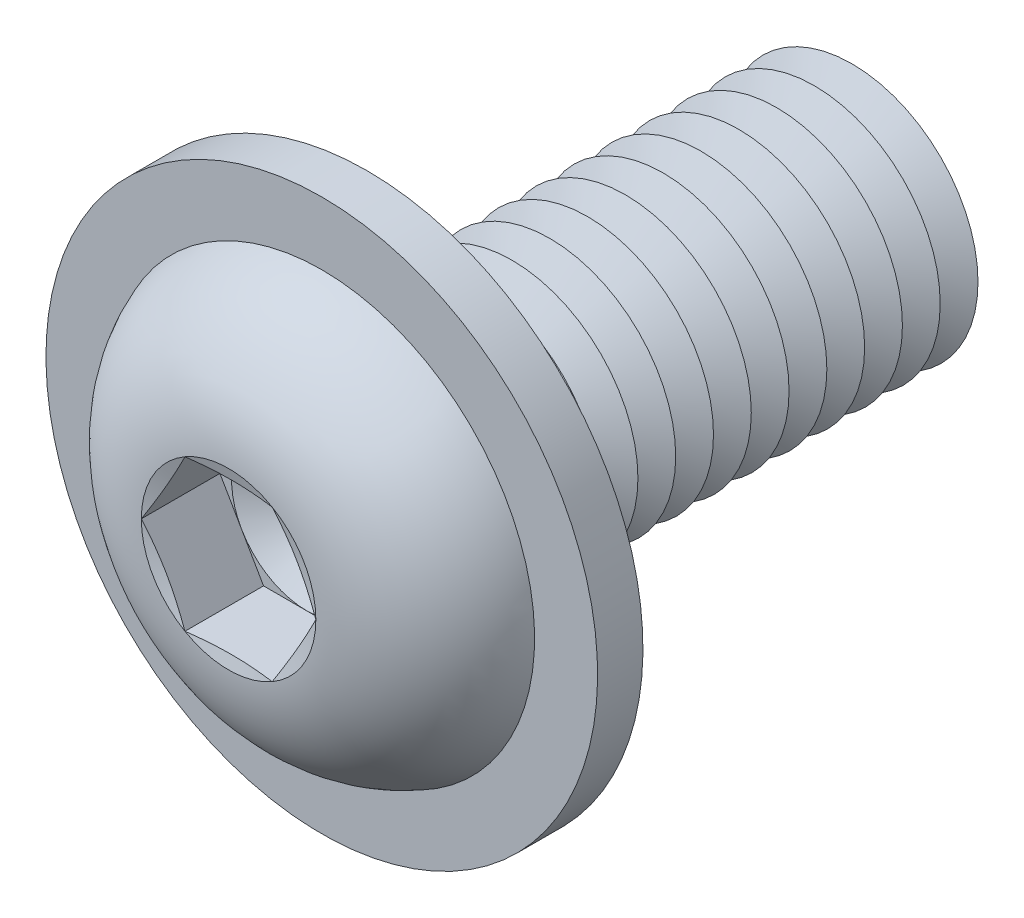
ISO-10303-21;
HEADER;
FILE_DESCRIPTION(('STEP AP214'),'2;1');
FILE_NAME('part.step','',(''),(''),'','','');
FILE_SCHEMA(('AUTOMOTIVE_DESIGN { 1 0 10303 214 1 1 1 1 }'));
ENDSEC;
DATA;
#1=APPLICATION_CONTEXT('core data for automotive mechanical design processes');
#2=APPLICATION_PROTOCOL_DEFINITION('international standard','automotive_design',2000,#1);
#3=PRODUCT_CONTEXT('',#1,'mechanical');
#4=PRODUCT('Part','Part','',(#3));
#5=PRODUCT_RELATED_PRODUCT_CATEGORY('part','',(#4));
#6=PRODUCT_DEFINITION_FORMATION('','',#4);
#7=PRODUCT_DEFINITION_CONTEXT('part definition',#1,'design');
#8=PRODUCT_DEFINITION('design','',#6,#7);
#9=PRODUCT_DEFINITION_SHAPE('','',#8);
#10=(LENGTH_UNIT() NAMED_UNIT(*) SI_UNIT(.MILLI.,.METRE.));
#11=(NAMED_UNIT(*) PLANE_ANGLE_UNIT() SI_UNIT($,.RADIAN.));
#12=(NAMED_UNIT(*) SI_UNIT($,.STERADIAN.) SOLID_ANGLE_UNIT());
#13=UNCERTAINTY_MEASURE_WITH_UNIT(LENGTH_MEASURE(1.E-05),#10,'distance_accuracy_value','');
#14=(GEOMETRIC_REPRESENTATION_CONTEXT(3) GLOBAL_UNCERTAINTY_ASSIGNED_CONTEXT((#13)) GLOBAL_UNIT_ASSIGNED_CONTEXT((#10,
#11,#12)) REPRESENTATION_CONTEXT('',''));
#15=CARTESIAN_POINT('',(0.,0.,0.));
#16=DIRECTION('',(0.,0.,1.));
#17=DIRECTION('',(1.,0.,0.));
#18=AXIS2_PLACEMENT_3D('',#15,#16,#17);
#19=CARTESIAN_POINT('',(0.,0.,-14.75));
#20=DIRECTION('',(0.,0.,1.));
#21=DIRECTION('',(1.,0.,0.));
#22=AXIS2_PLACEMENT_3D('',#19,#20,#21);
#23=CONICAL_SURFACE('',#22,5.,1.0471975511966);
#24=CARTESIAN_POINT('',(0.,0.,-15.5));
#25=DIRECTION('',(0.,0.,1.));
#26=DIRECTION('',(1.,0.,0.));
#27=AXIS2_PLACEMENT_3D('',#24,#25,#26);
#28=CIRCLE('',#27,3.70096189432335);
#29=CARTESIAN_POINT('',(3.70096189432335,0.,-15.5));
#30=VERTEX_POINT('',#29);
#31=EDGE_CURVE('E383',#30,#30,#28,.T.);
#32=ORIENTED_EDGE('',*,*,#31,.T.);
#33=EDGE_LOOP('',(#32));
#34=FACE_BOUND('',#33,.T.);
#35=CARTESIAN_POINT('',(0.,0.,-14.75));
#36=DIRECTION('',(0.,0.,1.));
#37=DIRECTION('',(1.,0.,0.));
#38=AXIS2_PLACEMENT_3D('',#35,#36,#37);
#39=CIRCLE('',#38,5.);
#40=CARTESIAN_POINT('',(5.,0.,-14.75));
#41=VERTEX_POINT('',#40);
#42=EDGE_CURVE('E398',#41,#41,#39,.T.);
#43=ORIENTED_EDGE('',*,*,#42,.F.);
#44=EDGE_LOOP('',(#43));
#45=FACE_BOUND('',#44,.T.);
#46=ADVANCED_FACE('F39',(#34,#45),#23,.T.);
#47=CARTESIAN_POINT('',(0.,0.,-15.5));
#48=DIRECTION('',(0.,0.,-1.));
#49=DIRECTION('',(-1.,0.,0.));
#50=AXIS2_PLACEMENT_3D('',#47,#48,#49);
#51=CONICAL_SURFACE('',#50,3.70096189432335,1.0471975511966);
#52=CARTESIAN_POINT('',(0.,0.,-16.25));
#53=DIRECTION('',(0.,0.,1.));
#54=DIRECTION('',(1.,0.,0.));
#55=AXIS2_PLACEMENT_3D('',#52,#53,#54);
#56=CIRCLE('',#55,5.);
#57=CARTESIAN_POINT('',(5.,0.,-16.25));
#58=VERTEX_POINT('',#57);
#59=EDGE_CURVE('E334',#58,#58,#56,.T.);
#60=ORIENTED_EDGE('',*,*,#59,.T.);
#61=EDGE_LOOP('',(#60));
#62=FACE_BOUND('',#61,.T.);
#63=ORIENTED_EDGE('',*,*,#31,.F.);
#64=EDGE_LOOP('',(#63));
#65=FACE_BOUND('',#64,.T.);
#66=ADVANCED_FACE('F467',(#62,#65),#51,.T.);
#67=CARTESIAN_POINT('',(0.,5.00000000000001,-20.));
#68=DIRECTION('',(0.,0.,-1.));
#69=DIRECTION('',(-1.,0.,0.));
#70=AXIS2_PLACEMENT_3D('',#67,#68,#69);
#71=PLANE('',#70);
#72=CARTESIAN_POINT('',(0.,0.,-20.));
#73=DIRECTION('',(0.,0.,1.));
#74=DIRECTION('',(1.,0.,0.));
#75=AXIS2_PLACEMENT_3D('',#72,#73,#74);
#76=CIRCLE('',#75,3.70096189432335);
#77=CARTESIAN_POINT('',(3.70096189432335,0.,-20.));
#78=VERTEX_POINT('',#77);
#79=EDGE_CURVE('E307',#78,#78,#76,.T.);
#80=ORIENTED_EDGE('',*,*,#79,.F.);
#81=EDGE_LOOP('',(#80));
#82=FACE_BOUND('',#81,.T.);
#83=ADVANCED_FACE('F473',(#82),#71,.T.);
#84=CARTESIAN_POINT('',(0.,0.,-19.25));
#85=DIRECTION('',(0.,0.,1.));
#86=DIRECTION('',(1.,0.,0.));
#87=AXIS2_PLACEMENT_3D('',#84,#85,#86);
#88=CONICAL_SURFACE('',#87,5.,1.0471975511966);
#89=ORIENTED_EDGE('',*,*,#79,.T.);
#90=EDGE_LOOP('',(#89));
#91=FACE_BOUND('',#90,.T.);
#92=CARTESIAN_POINT('',(0.,0.,-19.25));
#93=DIRECTION('',(0.,0.,1.));
#94=DIRECTION('',(1.,0.,0.));
#95=AXIS2_PLACEMENT_3D('',#92,#93,#94);
#96=CIRCLE('',#95,5.);
#97=CARTESIAN_POINT('',(5.,0.,-19.25));
#98=VERTEX_POINT('',#97);
#99=EDGE_CURVE('E388',#98,#98,#96,.T.);
#100=ORIENTED_EDGE('',*,*,#99,.F.);
#101=EDGE_LOOP('',(#100));
#102=FACE_BOUND('',#101,.T.);
#103=ADVANCED_FACE('F492',(#91,#102),#88,.T.);
#104=CARTESIAN_POINT('',(0.,0.,-18.5));
#105=DIRECTION('',(0.,0.,-1.));
#106=DIRECTION('',(-1.,0.,0.));
#107=AXIS2_PLACEMENT_3D('',#104,#105,#106);
#108=CONICAL_SURFACE('',#107,3.70096189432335,1.0471975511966);
#109=ORIENTED_EDGE('',*,*,#99,.T.);
#110=EDGE_LOOP('',(#109));
#111=FACE_BOUND('',#110,.T.);
#112=CARTESIAN_POINT('',(0.,0.,-18.5));
#113=DIRECTION('',(0.,0.,1.));
#114=DIRECTION('',(1.,0.,0.));
#115=AXIS2_PLACEMENT_3D('',#112,#113,#114);
#116=CIRCLE('',#115,3.70096189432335);
#117=CARTESIAN_POINT('',(3.70096189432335,0.,-18.5));
#118=VERTEX_POINT('',#117);
#119=EDGE_CURVE('E360',#118,#118,#116,.T.);
#120=ORIENTED_EDGE('',*,*,#119,.F.);
#121=EDGE_LOOP('',(#120));
#122=FACE_BOUND('',#121,.T.);
#123=ADVANCED_FACE('F489',(#111,#122),#108,.T.);
#124=CARTESIAN_POINT('',(0.,0.,-17.75));
#125=DIRECTION('',(0.,0.,1.));
#126=DIRECTION('',(1.,0.,0.));
#127=AXIS2_PLACEMENT_3D('',#124,#125,#126);
#128=CONICAL_SURFACE('',#127,5.,1.0471975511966);
#129=ORIENTED_EDGE('',*,*,#119,.T.);
#130=EDGE_LOOP('',(#129));
#131=FACE_BOUND('',#130,.T.);
#132=CARTESIAN_POINT('',(0.,0.,-17.75));
#133=DIRECTION('',(0.,0.,1.));
#134=DIRECTION('',(1.,0.,0.));
#135=AXIS2_PLACEMENT_3D('',#132,#133,#134);
#136=CIRCLE('',#135,5.);
#137=CARTESIAN_POINT('',(5.,0.,-17.75));
#138=VERTEX_POINT('',#137);
#139=EDGE_CURVE('E333',#138,#138,#136,.T.);
#140=ORIENTED_EDGE('',*,*,#139,.F.);
#141=EDGE_LOOP('',(#140));
#142=FACE_BOUND('',#141,.T.);
#143=ADVANCED_FACE('F483',(#131,#142),#128,.T.);
#144=CARTESIAN_POINT('',(0.,0.,-17.));
#145=DIRECTION('',(0.,0.,-1.));
#146=DIRECTION('',(-1.,0.,0.));
#147=AXIS2_PLACEMENT_3D('',#144,#145,#146);
#148=CONICAL_SURFACE('',#147,3.70096189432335,1.0471975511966);
#149=ORIENTED_EDGE('',*,*,#139,.T.);
#150=EDGE_LOOP('',(#149));
#151=FACE_BOUND('',#150,.T.);
#152=CARTESIAN_POINT('',(0.,0.,-17.));
#153=DIRECTION('',(0.,0.,1.));
#154=DIRECTION('',(1.,0.,0.));
#155=AXIS2_PLACEMENT_3D('',#152,#153,#154);
#156=CIRCLE('',#155,3.70096189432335);
#157=CARTESIAN_POINT('',(3.70096189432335,0.,-17.));
#158=VERTEX_POINT('',#157);
#159=EDGE_CURVE('E331',#158,#158,#156,.T.);
#160=ORIENTED_EDGE('',*,*,#159,.F.);
#161=EDGE_LOOP('',(#160));
#162=FACE_BOUND('',#161,.T.);
#163=ADVANCED_FACE('F479',(#151,#162),#148,.T.);
#164=CARTESIAN_POINT('',(0.,0.,-16.25));
#165=DIRECTION('',(0.,0.,1.));
#166=DIRECTION('',(1.,0.,0.));
#167=AXIS2_PLACEMENT_3D('',#164,#165,#166);
#168=CONICAL_SURFACE('',#167,5.,1.0471975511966);
#169=ORIENTED_EDGE('',*,*,#159,.T.);
#170=EDGE_LOOP('',(#169));
#171=FACE_BOUND('',#170,.T.);
#172=ORIENTED_EDGE('',*,*,#59,.F.);
#173=EDGE_LOOP('',(#172));
#174=FACE_BOUND('',#173,.T.);
#175=ADVANCED_FACE('F482',(#171,#174),#168,.T.);
#176=CARTESIAN_POINT('',(0.,0.,-13.25));
#177=DIRECTION('',(0.,0.,1.));
#178=DIRECTION('',(1.,0.,0.));
#179=AXIS2_PLACEMENT_3D('',#176,#177,#178);
#180=CONICAL_SURFACE('',#179,5.,1.0471975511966);
#181=CARTESIAN_POINT('',(0.,0.,-14.));
#182=DIRECTION('',(0.,0.,1.));
#183=DIRECTION('',(1.,0.,0.));
#184=AXIS2_PLACEMENT_3D('',#181,#182,#183);
#185=CIRCLE('',#184,3.70096189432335);
#186=CARTESIAN_POINT('',(3.70096189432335,0.,-14.));
#187=VERTEX_POINT('',#186);
#188=EDGE_CURVE('E419',#187,#187,#185,.T.);
#189=ORIENTED_EDGE('',*,*,#188,.T.);
#190=EDGE_LOOP('',(#189));
#191=FACE_BOUND('',#190,.T.);
#192=CARTESIAN_POINT('',(0.,0.,-13.25));
#193=DIRECTION('',(0.,0.,1.));
#194=DIRECTION('',(1.,0.,0.));
#195=AXIS2_PLACEMENT_3D('',#192,#193,#194);
#196=CIRCLE('',#195,5.);
#197=CARTESIAN_POINT('',(5.,0.,-13.25));
#198=VERTEX_POINT('',#197);
#199=EDGE_CURVE('E373',#198,#198,#196,.T.);
#200=ORIENTED_EDGE('',*,*,#199,.F.);
#201=EDGE_LOOP('',(#200));
#202=FACE_BOUND('',#201,.T.);
#203=ADVANCED_FACE('F487',(#191,#202),#180,.T.);
#204=CARTESIAN_POINT('',(0.,0.,-14.));
#205=DIRECTION('',(0.,0.,-1.));
#206=DIRECTION('',(-1.,0.,0.));
#207=AXIS2_PLACEMENT_3D('',#204,#205,#206);
#208=CONICAL_SURFACE('',#207,3.70096189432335,1.0471975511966);
#209=ORIENTED_EDGE('',*,*,#42,.T.);
#210=EDGE_LOOP('',(#209));
#211=FACE_BOUND('',#210,.T.);
#212=ORIENTED_EDGE('',*,*,#188,.F.);
#213=EDGE_LOOP('',(#212));
#214=FACE_BOUND('',#213,.T.);
#215=ADVANCED_FACE('F539',(#211,#214),#208,.T.);
#216=CARTESIAN_POINT('',(0.,0.,-11.75));
#217=DIRECTION('',(0.,0.,1.));
#218=DIRECTION('',(1.,0.,0.));
#219=AXIS2_PLACEMENT_3D('',#216,#217,#218);
#220=CONICAL_SURFACE('',#219,5.,1.0471975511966);
#221=CARTESIAN_POINT('',(0.,0.,-12.5));
#222=DIRECTION('',(0.,0.,1.));
#223=DIRECTION('',(1.,0.,0.));
#224=AXIS2_PLACEMENT_3D('',#221,#222,#223);
#225=CIRCLE('',#224,3.70096189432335);
#226=CARTESIAN_POINT('',(3.70096189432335,0.,-12.5));
#227=VERTEX_POINT('',#226);
#228=EDGE_CURVE('E370',#227,#227,#225,.T.);
#229=ORIENTED_EDGE('',*,*,#228,.T.);
#230=EDGE_LOOP('',(#229));
#231=FACE_BOUND('',#230,.T.);
#232=CARTESIAN_POINT('',(0.,0.,-11.75));
#233=DIRECTION('',(0.,0.,1.));
#234=DIRECTION('',(1.,0.,0.));
#235=AXIS2_PLACEMENT_3D('',#232,#233,#234);
#236=CIRCLE('',#235,5.);
#237=CARTESIAN_POINT('',(5.,0.,-11.75));
#238=VERTEX_POINT('',#237);
#239=EDGE_CURVE('E339',#238,#238,#236,.T.);
#240=ORIENTED_EDGE('',*,*,#239,.F.);
#241=EDGE_LOOP('',(#240));
#242=FACE_BOUND('',#241,.T.);
#243=ADVANCED_FACE('F545',(#231,#242),#220,.T.);
#244=CARTESIAN_POINT('',(0.,0.,-12.5));
#245=DIRECTION('',(0.,0.,-1.));
#246=DIRECTION('',(-1.,0.,0.));
#247=AXIS2_PLACEMENT_3D('',#244,#245,#246);
#248=CONICAL_SURFACE('',#247,3.70096189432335,1.0471975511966);
#249=ORIENTED_EDGE('',*,*,#199,.T.);
#250=EDGE_LOOP('',(#249));
#251=FACE_BOUND('',#250,.T.);
#252=ORIENTED_EDGE('',*,*,#228,.F.);
#253=EDGE_LOOP('',(#252));
#254=FACE_BOUND('',#253,.T.);
#255=ADVANCED_FACE('F552',(#251,#254),#248,.T.);
#256=CARTESIAN_POINT('',(0.,0.,-10.25));
#257=DIRECTION('',(0.,0.,1.));
#258=DIRECTION('',(1.,0.,0.));
#259=AXIS2_PLACEMENT_3D('',#256,#257,#258);
#260=CONICAL_SURFACE('',#259,5.,1.0471975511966);
#261=CARTESIAN_POINT('',(0.,0.,-11.));
#262=DIRECTION('',(0.,0.,1.));
#263=DIRECTION('',(1.,0.,0.));
#264=AXIS2_PLACEMENT_3D('',#261,#262,#263);
#265=CIRCLE('',#264,3.70096189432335);
#266=CARTESIAN_POINT('',(3.70096189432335,0.,-11.));
#267=VERTEX_POINT('',#266);
#268=EDGE_CURVE('E337',#267,#267,#265,.T.);
#269=ORIENTED_EDGE('',*,*,#268,.T.);
#270=EDGE_LOOP('',(#269));
#271=FACE_BOUND('',#270,.T.);
#272=CARTESIAN_POINT('',(0.,0.,-10.25));
#273=DIRECTION('',(0.,0.,1.));
#274=DIRECTION('',(1.,0.,0.));
#275=AXIS2_PLACEMENT_3D('',#272,#273,#274);
#276=CIRCLE('',#275,5.);
#277=CARTESIAN_POINT('',(5.,0.,-10.25));
#278=VERTEX_POINT('',#277);
#279=EDGE_CURVE('E340',#278,#278,#276,.T.);
#280=ORIENTED_EDGE('',*,*,#279,.F.);
#281=EDGE_LOOP('',(#280));
#282=FACE_BOUND('',#281,.T.);
#283=ADVANCED_FACE('F559',(#271,#282),#260,.T.);
#284=CARTESIAN_POINT('',(0.,0.,-11.));
#285=DIRECTION('',(0.,0.,-1.));
#286=DIRECTION('',(-1.,0.,0.));
#287=AXIS2_PLACEMENT_3D('',#284,#285,#286);
#288=CONICAL_SURFACE('',#287,3.70096189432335,1.0471975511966);
#289=ORIENTED_EDGE('',*,*,#239,.T.);
#290=EDGE_LOOP('',(#289));
#291=FACE_BOUND('',#290,.T.);
#292=ORIENTED_EDGE('',*,*,#268,.F.);
#293=EDGE_LOOP('',(#292));
#294=FACE_BOUND('',#293,.T.);
#295=ADVANCED_FACE('F565',(#291,#294),#288,.T.);
#296=CARTESIAN_POINT('',(0.,0.,-8.75));
#297=DIRECTION('',(0.,0.,1.));
#298=DIRECTION('',(1.,0.,0.));
#299=AXIS2_PLACEMENT_3D('',#296,#297,#298);
#300=CONICAL_SURFACE('',#299,5.,1.0471975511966);
#301=CARTESIAN_POINT('',(0.,0.,-9.5));
#302=DIRECTION('',(0.,0.,1.));
#303=DIRECTION('',(1.,0.,0.));
#304=AXIS2_PLACEMENT_3D('',#301,#302,#303);
#305=CIRCLE('',#304,3.70096189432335);
#306=CARTESIAN_POINT('',(3.70096189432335,0.,-9.5));
#307=VERTEX_POINT('',#306);
#308=EDGE_CURVE('E366',#307,#307,#305,.T.);
#309=ORIENTED_EDGE('',*,*,#308,.T.);
#310=EDGE_LOOP('',(#309));
#311=FACE_BOUND('',#310,.T.);
#312=CARTESIAN_POINT('',(0.,0.,-8.75));
#313=DIRECTION('',(0.,0.,1.));
#314=DIRECTION('',(1.,0.,0.));
#315=AXIS2_PLACEMENT_3D('',#312,#313,#314);
#316=CIRCLE('',#315,5.);
#317=CARTESIAN_POINT('',(5.,0.,-8.75));
#318=VERTEX_POINT('',#317);
#319=EDGE_CURVE('E326',#318,#318,#316,.T.);
#320=ORIENTED_EDGE('',*,*,#319,.F.);
#321=EDGE_LOOP('',(#320));
#322=FACE_BOUND('',#321,.T.);
#323=ADVANCED_FACE('F572',(#311,#322),#300,.T.);
#324=CARTESIAN_POINT('',(0.,0.,-9.5));
#325=DIRECTION('',(0.,0.,-1.));
#326=DIRECTION('',(-1.,0.,0.));
#327=AXIS2_PLACEMENT_3D('',#324,#325,#326);
#328=CONICAL_SURFACE('',#327,3.70096189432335,1.0471975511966);
#329=ORIENTED_EDGE('',*,*,#279,.T.);
#330=EDGE_LOOP('',(#329));
#331=FACE_BOUND('',#330,.T.);
#332=ORIENTED_EDGE('',*,*,#308,.F.);
#333=EDGE_LOOP('',(#332));
#334=FACE_BOUND('',#333,.T.);
#335=ADVANCED_FACE('F579',(#331,#334),#328,.T.);
#336=CARTESIAN_POINT('',(0.,0.,-7.25));
#337=DIRECTION('',(0.,0.,1.));
#338=DIRECTION('',(1.,0.,0.));
#339=AXIS2_PLACEMENT_3D('',#336,#337,#338);
#340=CONICAL_SURFACE('',#339,5.,1.0471975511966);
#341=CARTESIAN_POINT('',(0.,0.,-8.));
#342=DIRECTION('',(0.,0.,1.));
#343=DIRECTION('',(1.,0.,0.));
#344=AXIS2_PLACEMENT_3D('',#341,#342,#343);
#345=CIRCLE('',#344,3.70096189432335);
#346=CARTESIAN_POINT('',(3.70096189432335,0.,-8.));
#347=VERTEX_POINT('',#346);
#348=EDGE_CURVE('E408',#347,#347,#345,.T.);
#349=ORIENTED_EDGE('',*,*,#348,.T.);
#350=EDGE_LOOP('',(#349));
#351=FACE_BOUND('',#350,.T.);
#352=CARTESIAN_POINT('',(0.,0.,-7.25));
#353=DIRECTION('',(0.,0.,1.));
#354=DIRECTION('',(1.,0.,0.));
#355=AXIS2_PLACEMENT_3D('',#352,#353,#354);
#356=CIRCLE('',#355,5.);
#357=CARTESIAN_POINT('',(5.,0.,-7.25));
#358=VERTEX_POINT('',#357);
#359=EDGE_CURVE('E406',#358,#358,#356,.T.);
#360=ORIENTED_EDGE('',*,*,#359,.F.);
#361=EDGE_LOOP('',(#360));
#362=FACE_BOUND('',#361,.T.);
#363=ADVANCED_FACE('F586',(#351,#362),#340,.T.);
#364=CARTESIAN_POINT('',(0.,0.,-8.));
#365=DIRECTION('',(0.,0.,-1.));
#366=DIRECTION('',(-1.,0.,0.));
#367=AXIS2_PLACEMENT_3D('',#364,#365,#366);
#368=CONICAL_SURFACE('',#367,3.70096189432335,1.0471975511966);
#369=ORIENTED_EDGE('',*,*,#319,.T.);
#370=EDGE_LOOP('',(#369));
#371=FACE_BOUND('',#370,.T.);
#372=ORIENTED_EDGE('',*,*,#348,.F.);
#373=EDGE_LOOP('',(#372));
#374=FACE_BOUND('',#373,.T.);
#375=ADVANCED_FACE('F464',(#371,#374),#368,.T.);
#376=CARTESIAN_POINT('',(0.,0.,-5.75));
#377=DIRECTION('',(0.,0.,1.));
#378=DIRECTION('',(1.,0.,0.));
#379=AXIS2_PLACEMENT_3D('',#376,#377,#378);
#380=CONICAL_SURFACE('',#379,5.,1.0471975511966);
#381=CARTESIAN_POINT('',(0.,0.,-6.5));
#382=DIRECTION('',(0.,0.,1.));
#383=DIRECTION('',(1.,0.,0.));
#384=AXIS2_PLACEMENT_3D('',#381,#382,#383);
#385=CIRCLE('',#384,3.70096189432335);
#386=CARTESIAN_POINT('',(3.70096189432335,0.,-6.5));
#387=VERTEX_POINT('',#386);
#388=EDGE_CURVE('E395',#387,#387,#385,.T.);
#389=ORIENTED_EDGE('',*,*,#388,.T.);
#390=EDGE_LOOP('',(#389));
#391=FACE_BOUND('',#390,.T.);
#392=CARTESIAN_POINT('',(0.,0.,-5.75000000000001));
#393=DIRECTION('',(0.,0.,1.));
#394=DIRECTION('',(1.,0.,0.));
#395=AXIS2_PLACEMENT_3D('',#392,#393,#394);
#396=CIRCLE('',#395,5.);
#397=CARTESIAN_POINT('',(5.,0.,-5.75000000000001));
#398=VERTEX_POINT('',#397);
#399=EDGE_CURVE('E352',#398,#398,#396,.T.);
#400=ORIENTED_EDGE('',*,*,#399,.F.);
#401=EDGE_LOOP('',(#400));
#402=FACE_BOUND('',#401,.T.);
#403=ADVANCED_FACE('F449',(#391,#402),#380,.T.);
#404=CARTESIAN_POINT('',(0.,0.,-6.5));
#405=DIRECTION('',(0.,0.,-1.));
#406=DIRECTION('',(-1.,0.,0.));
#407=AXIS2_PLACEMENT_3D('',#404,#405,#406);
#408=CONICAL_SURFACE('',#407,3.70096189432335,1.0471975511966);
#409=ORIENTED_EDGE('',*,*,#359,.T.);
#410=EDGE_LOOP('',(#409));
#411=FACE_BOUND('',#410,.T.);
#412=ORIENTED_EDGE('',*,*,#388,.F.);
#413=EDGE_LOOP('',(#412));
#414=FACE_BOUND('',#413,.T.);
#415=ADVANCED_FACE('F452',(#411,#414),#408,.T.);
#416=CARTESIAN_POINT('',(0.,0.,-4.25));
#417=DIRECTION('',(0.,0.,1.));
#418=DIRECTION('',(1.,0.,0.));
#419=AXIS2_PLACEMENT_3D('',#416,#417,#418);
#420=CONICAL_SURFACE('',#419,5.,1.0471975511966);
#421=CARTESIAN_POINT('',(0.,0.,-5.));
#422=DIRECTION('',(0.,0.,1.));
#423=DIRECTION('',(1.,0.,0.));
#424=AXIS2_PLACEMENT_3D('',#421,#422,#423);
#425=CIRCLE('',#424,3.70096189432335);
#426=CARTESIAN_POINT('',(3.70096189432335,0.,-5.));
#427=VERTEX_POINT('',#426);
#428=EDGE_CURVE('E349',#427,#427,#425,.T.);
#429=ORIENTED_EDGE('',*,*,#428,.T.);
#430=EDGE_LOOP('',(#429));
#431=FACE_BOUND('',#430,.T.);
#432=CARTESIAN_POINT('',(0.,0.,-4.25));
#433=DIRECTION('',(0.,0.,1.));
#434=DIRECTION('',(1.,0.,0.));
#435=AXIS2_PLACEMENT_3D('',#432,#433,#434);
#436=CIRCLE('',#435,5.);
#437=CARTESIAN_POINT('',(5.,0.,-4.25));
#438=VERTEX_POINT('',#437);
#439=EDGE_CURVE('E346',#438,#438,#436,.T.);
#440=ORIENTED_EDGE('',*,*,#439,.F.);
#441=EDGE_LOOP('',(#440));
#442=FACE_BOUND('',#441,.T.);
#443=ADVANCED_FACE('F454',(#431,#442),#420,.T.);
#444=CARTESIAN_POINT('',(0.,0.,-5.));
#445=DIRECTION('',(0.,0.,-1.));
#446=DIRECTION('',(-1.,0.,0.));
#447=AXIS2_PLACEMENT_3D('',#444,#445,#446);
#448=CONICAL_SURFACE('',#447,3.70096189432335,1.0471975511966);
#449=ORIENTED_EDGE('',*,*,#399,.T.);
#450=EDGE_LOOP('',(#449));
#451=FACE_BOUND('',#450,.T.);
#452=ORIENTED_EDGE('',*,*,#428,.F.);
#453=EDGE_LOOP('',(#452));
#454=FACE_BOUND('',#453,.T.);
#455=ADVANCED_FACE('F461',(#451,#454),#448,.T.);
#456=CARTESIAN_POINT('',(0.,0.,-2.75));
#457=DIRECTION('',(0.,0.,1.));
#458=DIRECTION('',(1.,0.,0.));
#459=AXIS2_PLACEMENT_3D('',#456,#457,#458);
#460=CONICAL_SURFACE('',#459,5.,1.0471975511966);
#461=CARTESIAN_POINT('',(0.,0.,-3.5));
#462=DIRECTION('',(0.,0.,1.));
#463=DIRECTION('',(1.,0.,0.));
#464=AXIS2_PLACEMENT_3D('',#461,#462,#463);
#465=CIRCLE('',#464,3.70096189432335);
#466=CARTESIAN_POINT('',(3.70096189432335,0.,-3.5));
#467=VERTEX_POINT('',#466);
#468=EDGE_CURVE('E343',#467,#467,#465,.T.);
#469=ORIENTED_EDGE('',*,*,#468,.T.);
#470=EDGE_LOOP('',(#469));
#471=FACE_BOUND('',#470,.T.);
#472=CARTESIAN_POINT('',(0.,0.,-2.75));
#473=DIRECTION('',(0.,0.,1.));
#474=DIRECTION('',(1.,0.,0.));
#475=AXIS2_PLACEMENT_3D('',#472,#473,#474);
#476=CIRCLE('',#475,5.);
#477=CARTESIAN_POINT('',(5.,0.,-2.75));
#478=VERTEX_POINT('',#477);
#479=EDGE_CURVE('E358',#478,#478,#476,.T.);
#480=ORIENTED_EDGE('',*,*,#479,.F.);
#481=EDGE_LOOP('',(#480));
#482=FACE_BOUND('',#481,.T.);
#483=ADVANCED_FACE('F618',(#471,#482),#460,.T.);
#484=CARTESIAN_POINT('',(0.,0.,-3.5));
#485=DIRECTION('',(0.,0.,-1.));
#486=DIRECTION('',(-1.,0.,0.));
#487=AXIS2_PLACEMENT_3D('',#484,#485,#486);
#488=CONICAL_SURFACE('',#487,3.70096189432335,1.0471975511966);
#489=ORIENTED_EDGE('',*,*,#439,.T.);
#490=EDGE_LOOP('',(#489));
#491=FACE_BOUND('',#490,.T.);
#492=ORIENTED_EDGE('',*,*,#468,.F.);
#493=EDGE_LOOP('',(#492));
#494=FACE_BOUND('',#493,.T.);
#495=ADVANCED_FACE('F627',(#491,#494),#488,.T.);
#496=CARTESIAN_POINT('',(0.,0.,-1.25));
#497=DIRECTION('',(0.,0.,1.));
#498=DIRECTION('',(1.,0.,0.));
#499=AXIS2_PLACEMENT_3D('',#496,#497,#498);
#500=CONICAL_SURFACE('',#499,5.,1.0471975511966);
#501=CARTESIAN_POINT('',(0.,0.,-2.));
#502=DIRECTION('',(0.,0.,1.));
#503=DIRECTION('',(1.,0.,0.));
#504=AXIS2_PLACEMENT_3D('',#501,#502,#503);
#505=CIRCLE('',#504,3.70096189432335);
#506=CARTESIAN_POINT('',(3.70096189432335,0.,-2.));
#507=VERTEX_POINT('',#506);
#508=EDGE_CURVE('E228',#507,#507,#505,.T.);
#509=ORIENTED_EDGE('',*,*,#508,.T.);
#510=EDGE_LOOP('',(#509));
#511=FACE_BOUND('',#510,.T.);
#512=CARTESIAN_POINT('',(0.,0.,-1.25));
#513=DIRECTION('',(0.,0.,1.));
#514=DIRECTION('',(1.,0.,0.));
#515=AXIS2_PLACEMENT_3D('',#512,#513,#514);
#516=CIRCLE('',#515,5.);
#517=CARTESIAN_POINT('',(5.,0.,-1.25));
#518=VERTEX_POINT('',#517);
#519=EDGE_CURVE('E347',#518,#518,#516,.T.);
#520=ORIENTED_EDGE('',*,*,#519,.F.);
#521=EDGE_LOOP('',(#520));
#522=FACE_BOUND('',#521,.T.);
#523=ADVANCED_FACE('F636',(#511,#522),#500,.T.);
#524=CARTESIAN_POINT('',(0.,0.,-2.));
#525=DIRECTION('',(0.,0.,-1.));
#526=DIRECTION('',(-1.,0.,0.));
#527=AXIS2_PLACEMENT_3D('',#524,#525,#526);
#528=CONICAL_SURFACE('',#527,3.70096189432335,1.0471975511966);
#529=ORIENTED_EDGE('',*,*,#479,.T.);
#530=EDGE_LOOP('',(#529));
#531=FACE_BOUND('',#530,.T.);
#532=ORIENTED_EDGE('',*,*,#508,.F.);
#533=EDGE_LOOP('',(#532));
#534=FACE_BOUND('',#533,.T.);
#535=ADVANCED_FACE('F212',(#531,#534),#528,.T.);
#536=CARTESIAN_POINT('',(0.,5.,0.));
#537=DIRECTION('',(0.,0.,-1.));
#538=DIRECTION('',(-1.,0.,0.));
#539=AXIS2_PLACEMENT_3D('',#536,#537,#538);
#540=PLANE('',#539);
#541=CARTESIAN_POINT('',(0.,0.,0.));
#542=DIRECTION('',(0.,0.,-1.));
#543=DIRECTION('',(-1.,0.,0.));
#544=AXIS2_PLACEMENT_3D('',#541,#542,#543);
#545=CIRCLE('',#544,5.75000000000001);
#546=CARTESIAN_POINT('',(-5.75000000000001,0.,0.));
#547=VERTEX_POINT('',#546);
#548=EDGE_CURVE('E283',#547,#547,#545,.F.);
#549=ORIENTED_EDGE('',*,*,#548,.T.);
#550=EDGE_LOOP('',(#549));
#551=FACE_BOUND('',#550,.T.);
#552=CARTESIAN_POINT('',(0.,0.,0.));
#553=DIRECTION('',(0.,0.,-1.));
#554=DIRECTION('',(0.,1.,0.));
#555=AXIS2_PLACEMENT_3D('',#552,#553,#554);
#556=CIRCLE('',#555,10.95);
#557=CARTESIAN_POINT('',(0.,10.95,0.));
#558=VERTEX_POINT('',#557);
#559=EDGE_CURVE('E380',#558,#558,#556,.T.);
#560=ORIENTED_EDGE('',*,*,#559,.T.);
#561=EDGE_LOOP('',(#560));
#562=FACE_BOUND('',#561,.T.);
#563=ADVANCED_FACE('F652',(#551,#562),#540,.T.);
#564=CARTESIAN_POINT('',(0.,0.,-0.750000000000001));
#565=DIRECTION('',(0.,0.,-1.));
#566=DIRECTION('',(-1.,0.,0.));
#567=AXIS2_PLACEMENT_3D('',#564,#565,#566);
#568=TOROIDAL_SURFACE('',#567,5.75000000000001,0.75);
#569=ORIENTED_EDGE('',*,*,#548,.F.);
#570=EDGE_LOOP('',(#569));
#571=FACE_BOUND('',#570,.T.);
#572=CARTESIAN_POINT('',(0.,0.,-0.750000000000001));
#573=DIRECTION('',(0.,0.,-1.));
#574=DIRECTION('',(-1.,0.,0.));
#575=AXIS2_PLACEMENT_3D('',#572,#573,#574);
#576=CIRCLE('',#575,5.00000000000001);
#577=CARTESIAN_POINT('',(-5.00000000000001,0.,-0.750000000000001));
#578=VERTEX_POINT('',#577);
#579=EDGE_CURVE('E288',#578,#578,#576,.T.);
#580=ORIENTED_EDGE('',*,*,#579,.F.);
#581=EDGE_LOOP('',(#580));
#582=FACE_BOUND('',#581,.T.);
#583=ADVANCED_FACE('F41',(#571,#582),#568,.F.);
#584=CARTESIAN_POINT('',(0.,0.,-20.));
#585=DIRECTION('',(0.,0.,-1.));
#586=DIRECTION('',(-1.,0.,0.));
#587=AXIS2_PLACEMENT_3D('',#584,#585,#586);
#588=CYLINDRICAL_SURFACE('',#587,5.00000000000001);
#589=ORIENTED_EDGE('',*,*,#579,.T.);
#590=EDGE_LOOP('',(#589));
#591=FACE_BOUND('',#590,.T.);
#592=ORIENTED_EDGE('',*,*,#519,.T.);
#593=EDGE_LOOP('',(#592));
#594=FACE_BOUND('',#593,.T.);
#595=ADVANCED_FACE('F670',(#591,#594),#588,.T.);
#596=CARTESIAN_POINT('',(0.,0.,1.8));
#597=DIRECTION('',(0.,0.,-1.));
#598=DIRECTION('',(0.,1.,0.));
#599=AXIS2_PLACEMENT_3D('',#596,#597,#598);
#600=CYLINDRICAL_SURFACE('',#599,10.95);
#601=CARTESIAN_POINT('',(0.,0.,1.8));
#602=DIRECTION('',(0.,0.,-1.));
#603=DIRECTION('',(0.,1.,0.));
#604=AXIS2_PLACEMENT_3D('',#601,#602,#603);
#605=CIRCLE('',#604,10.95);
#606=CARTESIAN_POINT('',(0.,10.95,1.8));
#607=VERTEX_POINT('',#606);
#608=EDGE_CURVE('E329',#607,#607,#605,.T.);
#609=ORIENTED_EDGE('',*,*,#608,.T.);
#610=EDGE_LOOP('',(#609));
#611=FACE_BOUND('',#610,.T.);
#612=ORIENTED_EDGE('',*,*,#559,.F.);
#613=EDGE_LOOP('',(#612));
#614=FACE_BOUND('',#613,.T.);
#615=ADVANCED_FACE('F677',(#611,#614),#600,.T.);
#616=CARTESIAN_POINT('',(0.,0.,1.8));
#617=DIRECTION('',(0.,0.,-1.));
#618=DIRECTION('',(0.,1.,0.));
#619=AXIS2_PLACEMENT_3D('',#616,#617,#618);
#620=PLANE('',#619);
#621=CARTESIAN_POINT('',(0.,0.,1.8));
#622=DIRECTION('',(0.,0.,-1.));
#623=DIRECTION('',(0.,1.,0.));
#624=AXIS2_PLACEMENT_3D('',#621,#622,#623);
#625=CIRCLE('',#624,8.44736706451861);
#626=CARTESIAN_POINT('',(0.,8.44736706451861,1.8));
#627=VERTEX_POINT('',#626);
#628=EDGE_CURVE('E43',#627,#627,#625,.F.);
#629=ORIENTED_EDGE('',*,*,#628,.F.);
#630=EDGE_LOOP('',(#629));
#631=FACE_BOUND('',#630,.T.);
#632=ORIENTED_EDGE('',*,*,#608,.F.);
#633=EDGE_LOOP('',(#632));
#634=FACE_BOUND('',#633,.T.);
#635=ADVANCED_FACE('F117',(#631,#634),#620,.F.);
#636=CARTESIAN_POINT('',(0.,0.,2.38));
#637=DIRECTION('',(0.,0.,1.));
#638=DIRECTION('',(1.,0.,0.));
#639=AXIS2_PLACEMENT_3D('',#636,#637,#638);
#640=CONICAL_SURFACE('',#639,2.99999860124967,1.0471975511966);
#641=CARTESIAN_POINT('',(0.,0.,0.64795000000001));
#642=VERTEX_POINT('',#641);
#643=VERTEX_LOOP('',#642);
#644=FACE_BOUND('',#643,.T.);
#645=CARTESIAN_POINT('',(0.,0.,2.38));
#646=DIRECTION('',(0.,0.,1.));
#647=DIRECTION('',(1.,0.,0.));
#648=AXIS2_PLACEMENT_3D('',#645,#646,#647);
#649=CIRCLE('',#648,2.99999860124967);
#650=CARTESIAN_POINT('',(2.598075,1.49999930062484,2.38));
#651=VERTEX_POINT('',#650);
#652=CARTESIAN_POINT('',(0.,2.99999860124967,2.38));
#653=VERTEX_POINT('',#652);
#654=EDGE_CURVE('E120',#651,#653,#649,.T.);
#655=ORIENTED_EDGE('',*,*,#654,.T.);
#656=CARTESIAN_POINT('',(0.,0.,2.38));
#657=DIRECTION('',(0.,0.,1.));
#658=DIRECTION('',(1.,0.,0.));
#659=AXIS2_PLACEMENT_3D('',#656,#657,#658);
#660=CIRCLE('',#659,2.99999860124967);
#661=CARTESIAN_POINT('',(-2.598075,1.49999930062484,2.38));
#662=VERTEX_POINT('',#661);
#663=EDGE_CURVE('E11',#653,#662,#660,.T.);
#664=ORIENTED_EDGE('',*,*,#663,.T.);
#665=CARTESIAN_POINT('',(-2.598075,-1.49999930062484,2.38));
#666=VERTEX_POINT('',#665);
#667=EDGE_CURVE('E49',#662,#666,#660,.T.);
#668=ORIENTED_EDGE('',*,*,#667,.T.);
#669=CARTESIAN_POINT('',(0.,-2.99999860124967,2.38));
#670=VERTEX_POINT('',#669);
#671=EDGE_CURVE('E286',#666,#670,#660,.T.);
#672=ORIENTED_EDGE('',*,*,#671,.T.);
#673=CARTESIAN_POINT('',(2.598075,-1.49999930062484,2.38));
#674=VERTEX_POINT('',#673);
#675=EDGE_CURVE('E57',#670,#674,#660,.T.);
#676=ORIENTED_EDGE('',*,*,#675,.T.);
#677=EDGE_CURVE('E50',#674,#651,#660,.T.);
#678=ORIENTED_EDGE('',*,*,#677,.T.);
#679=EDGE_LOOP('',(#655,#664,#668,#672,#676,#678));
#680=FACE_BOUND('',#679,.T.);
#681=ADVANCED_FACE('F114',(#644,#680),#640,.F.);
#682=CARTESIAN_POINT('',(0.,0.,2.38));
#683=DIRECTION('',(0.,0.,1.));
#684=DIRECTION('',(1.,0.,0.));
#685=AXIS2_PLACEMENT_3D('',#682,#683,#684);
#686=PLANE('',#685);
#687=ORIENTED_EDGE('',*,*,#671,.F.);
#688=DIRECTION('',(0.5,-0.866025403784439,0.));
#689=VECTOR('',#688,1.);
#690=CARTESIAN_POINT('',(-3.4641,0.,2.38));
#691=LINE('',#690,#689);
#692=CARTESIAN_POINT('',(-1.73205,-2.99999860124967,2.38));
#693=VERTEX_POINT('',#692);
#694=EDGE_CURVE('E154',#666,#693,#691,.T.);
#695=ORIENTED_EDGE('',*,*,#694,.T.);
#696=DIRECTION('',(1.,0.,0.));
#697=VECTOR('',#696,1.);
#698=CARTESIAN_POINT('',(-1.73205,-2.99999860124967,2.38));
#699=LINE('',#698,#697);
#700=EDGE_CURVE('E160',#693,#670,#699,.T.);
#701=ORIENTED_EDGE('',*,*,#700,.T.);
#702=EDGE_LOOP('',(#687,#695,#701));
#703=FACE_BOUND('',#702,.T.);
#704=ADVANCED_FACE('F116',(#703),#686,.T.);
#705=ORIENTED_EDGE('',*,*,#675,.F.);
#706=CARTESIAN_POINT('',(1.73205,-2.99999860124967,2.38));
#707=VERTEX_POINT('',#706);
#708=EDGE_CURVE('E159',#670,#707,#699,.T.);
#709=ORIENTED_EDGE('',*,*,#708,.T.);
#710=DIRECTION('',(0.5,0.866025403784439,0.));
#711=VECTOR('',#710,1.);
#712=CARTESIAN_POINT('',(1.73205,-2.99999860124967,2.38));
#713=LINE('',#712,#711);
#714=EDGE_CURVE('E165',#707,#674,#713,.T.);
#715=ORIENTED_EDGE('',*,*,#714,.T.);
#716=EDGE_LOOP('',(#705,#709,#715));
#717=FACE_BOUND('',#716,.T.);
#718=ADVANCED_FACE('F707',(#717),#686,.T.);
#719=ORIENTED_EDGE('',*,*,#677,.F.);
#720=CARTESIAN_POINT('',(3.4641,0.,2.38));
#721=VERTEX_POINT('',#720);
#722=EDGE_CURVE('E164',#674,#721,#713,.T.);
#723=ORIENTED_EDGE('',*,*,#722,.T.);
#724=DIRECTION('',(-0.5,0.866025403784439,0.));
#725=VECTOR('',#724,1.);
#726=CARTESIAN_POINT('',(3.4641,0.,2.38));
#727=LINE('',#726,#725);
#728=EDGE_CURVE('E142',#721,#651,#727,.T.);
#729=ORIENTED_EDGE('',*,*,#728,.T.);
#730=EDGE_LOOP('',(#719,#723,#729));
#731=FACE_BOUND('',#730,.T.);
#732=ADVANCED_FACE('F716',(#731),#686,.T.);
#733=ORIENTED_EDGE('',*,*,#654,.F.);
#734=CARTESIAN_POINT('',(1.73205,2.99999860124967,2.38));
#735=VERTEX_POINT('',#734);
#736=EDGE_CURVE('E127',#651,#735,#727,.T.);
#737=ORIENTED_EDGE('',*,*,#736,.T.);
#738=DIRECTION('',(-1.,0.,0.));
#739=VECTOR('',#738,1.);
#740=CARTESIAN_POINT('',(1.73205,2.99999860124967,2.38));
#741=LINE('',#740,#739);
#742=EDGE_CURVE('E138',#735,#653,#741,.T.);
#743=ORIENTED_EDGE('',*,*,#742,.T.);
#744=EDGE_LOOP('',(#733,#737,#743));
#745=FACE_BOUND('',#744,.T.);
#746=ADVANCED_FACE('F144',(#745),#686,.T.);
#747=ORIENTED_EDGE('',*,*,#663,.F.);
#748=CARTESIAN_POINT('',(-1.73205,2.99999860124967,2.38));
#749=VERTEX_POINT('',#748);
#750=EDGE_CURVE('E133',#653,#749,#741,.T.);
#751=ORIENTED_EDGE('',*,*,#750,.T.);
#752=DIRECTION('',(-0.5,-0.866025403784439,0.));
#753=VECTOR('',#752,1.);
#754=CARTESIAN_POINT('',(-1.73205,2.99999860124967,2.38));
#755=LINE('',#754,#753);
#756=EDGE_CURVE('E136',#749,#662,#755,.T.);
#757=ORIENTED_EDGE('',*,*,#756,.T.);
#758=EDGE_LOOP('',(#747,#751,#757));
#759=FACE_BOUND('',#758,.T.);
#760=ADVANCED_FACE('F132',(#759),#686,.T.);
#761=ORIENTED_EDGE('',*,*,#667,.F.);
#762=CARTESIAN_POINT('',(-3.4641,0.,2.38));
#763=VERTEX_POINT('',#762);
#764=EDGE_CURVE('E146',#662,#763,#755,.T.);
#765=ORIENTED_EDGE('',*,*,#764,.T.);
#766=EDGE_CURVE('E155',#763,#666,#691,.T.);
#767=ORIENTED_EDGE('',*,*,#766,.T.);
#768=EDGE_LOOP('',(#761,#765,#767));
#769=FACE_BOUND('',#768,.T.);
#770=ADVANCED_FACE('F263',(#769),#686,.T.);
#771=CARTESIAN_POINT('',(-3.4641,0.,2.38));
#772=DIRECTION('',(-0.866025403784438,-0.5,0.));
#773=DIRECTION('',(0.5,-0.866025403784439,0.));
#774=AXIS2_PLACEMENT_3D('',#771,#772,#773);
#775=PLANE('',#774);
#776=CARTESIAN_POINT('',(-3.46421547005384,0.000200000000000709,5.50003094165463));
#777=CARTESIAN_POINT('',(-3.39227822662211,-0.12439896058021,5.48074619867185));
#778=CARTESIAN_POINT('',(-3.32021054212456,-0.249223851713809,5.46323875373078));
#779=CARTESIAN_POINT('',(-3.17582062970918,-0.499314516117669,5.43247971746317));
#780=CARTESIAN_POINT('',(-3.10349831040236,-0.624580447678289,5.41922985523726));
#781=CARTESIAN_POINT('',(-2.95903767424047,-0.874793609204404,5.39775958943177));
#782=CARTESIAN_POINT('',(-2.88690033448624,-0.999739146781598,5.38951357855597));
#783=CARTESIAN_POINT('',(-2.74253364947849,-1.24978958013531,5.37845651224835));
#784=CARTESIAN_POINT('',(-2.67030432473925,-1.37489444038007,5.3756444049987));
#785=CARTESIAN_POINT('',(-2.52584567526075,-1.6251041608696,5.3756444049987));
#786=CARTESIAN_POINT('',(-2.45361635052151,-1.75020902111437,5.37845651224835));
#787=CARTESIAN_POINT('',(-2.30924966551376,-2.00025945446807,5.38951357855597));
#788=CARTESIAN_POINT('',(-2.23711232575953,-2.12520499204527,5.39775958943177));
#789=CARTESIAN_POINT('',(-2.09265168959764,-2.37541815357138,5.41922985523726));
#790=CARTESIAN_POINT('',(-2.02032937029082,-2.500684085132,5.43247971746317));
#791=CARTESIAN_POINT('',(-1.87593945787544,-2.75077474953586,5.46323875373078));
#792=CARTESIAN_POINT('',(-1.80387177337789,-2.87559964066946,5.48074619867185));
#793=CARTESIAN_POINT('',(-1.73193452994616,-3.00019860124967,5.50003094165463));
#794=B_SPLINE_CURVE_WITH_KNOTS('',3,(#776,#777,#778,#779,#780,#781,#782,#783,#784,#785,#786,
#787,#788,#789,#790,#791,#792,#793),.UNSPECIFIED.,.F.,.F.,(4,2,2,2,2,2,2,2,4),(0.,
0.435506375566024,0.871189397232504,1.3046235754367,1.7379738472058,2.1713241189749,
2.6047582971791,3.04044131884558,3.4759476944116),.UNSPECIFIED.);
#795=CARTESIAN_POINT('',(-3.4641,0.,5.5));
#796=VERTEX_POINT('',#795);
#797=CARTESIAN_POINT('',(-1.73205,-2.99999860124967,5.5));
#798=VERTEX_POINT('',#797);
#799=EDGE_CURVE('E239',#796,#798,#794,.T.);
#800=ORIENTED_EDGE('',*,*,#799,.T.);
#801=DIRECTION('',(0.,0.,1.));
#802=VECTOR('',#801,1.);
#803=CARTESIAN_POINT('',(-1.73205,-2.99999860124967,2.38));
#804=LINE('',#803,#802);
#805=EDGE_CURVE('E179',#693,#798,#804,.T.);
#806=ORIENTED_EDGE('',*,*,#805,.F.);
#807=ORIENTED_EDGE('',*,*,#694,.F.);
#808=ORIENTED_EDGE('',*,*,#766,.F.);
#809=DIRECTION('',(0.,0.,1.));
#810=VECTOR('',#809,1.);
#811=CARTESIAN_POINT('',(-3.4641,0.,2.38));
#812=LINE('',#811,#810);
#813=EDGE_CURVE('E175',#763,#796,#812,.T.);
#814=ORIENTED_EDGE('',*,*,#813,.T.);
#815=EDGE_LOOP('',(#800,#806,#807,#808,#814));
#816=FACE_BOUND('',#815,.T.);
#817=ADVANCED_FACE('F257',(#816),#775,.F.);
#818=CARTESIAN_POINT('',(-1.73205,-2.99999860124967,2.38));
#819=DIRECTION('',(0.,-1.,0.));
#820=DIRECTION('',(0.,0.,-1.));
#821=AXIS2_PLACEMENT_3D('',#818,#819,#820);
#822=PLANE('',#821);
#823=CARTESIAN_POINT('',(-5.2273006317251,-2.99999860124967,6.18672552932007));
#824=CARTESIAN_POINT('',(-5.10075887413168,-2.99999860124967,6.15732018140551));
#825=CARTESIAN_POINT('',(-4.97415993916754,-2.99999860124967,6.12816064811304));
#826=CARTESIAN_POINT('',(-4.72082394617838,-2.99999860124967,6.07043857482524));
#827=CARTESIAN_POINT('',(-4.59408688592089,-2.99999860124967,6.04187604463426));
#828=CARTESIAN_POINT('',(-4.21358997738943,-2.99999860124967,5.95723252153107));
#829=CARTESIAN_POINT('',(-3.95959339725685,-2.99999860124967,5.90220706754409));
#830=CARTESIAN_POINT('',(-3.44835573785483,-2.99999860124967,5.79574115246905));
#831=CARTESIAN_POINT('',(-3.19110656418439,-2.99999860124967,5.74433913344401));
#832=CARTESIAN_POINT('',(-2.67540790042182,-2.99999860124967,5.6477299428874));
#833=CARTESIAN_POINT('',(-2.41695830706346,-2.99999860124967,5.60252331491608));
#834=CARTESIAN_POINT('',(-1.9055512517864,-2.99999860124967,5.52251897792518));
#835=CARTESIAN_POINT('',(-1.65263426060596,-2.99999860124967,5.48747285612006));
#836=CARTESIAN_POINT('',(-1.27220564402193,-2.99999860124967,5.44439602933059));
#837=CARTESIAN_POINT('',(-1.1452320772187,-2.99999860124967,5.43161987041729));
#838=CARTESIAN_POINT('',(-0.890973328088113,-2.99999860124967,5.40972605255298));
#839=CARTESIAN_POINT('',(-0.76368816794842,-2.99999860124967,5.40060814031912));
#840=CARTESIAN_POINT('',(-0.509442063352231,-2.99999860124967,5.38647457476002));
#841=CARTESIAN_POINT('',(-0.382482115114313,-2.99999860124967,5.38144125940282));
#842=CARTESIAN_POINT('',(-0.128463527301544,-2.99999860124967,5.37566637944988));
#843=CARTESIAN_POINT('',(-0.00140488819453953,-2.99999860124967,5.37492479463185));
#844=CARTESIAN_POINT('',(0.252672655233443,-2.99999860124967,5.37777315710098));
#845=CARTESIAN_POINT('',(0.379691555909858,-2.99999860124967,5.38136342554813));
#846=CARTESIAN_POINT('',(0.63354019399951,-2.99999860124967,5.39268816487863));
#847=CARTESIAN_POINT('',(0.760369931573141,-2.99999860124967,5.40042263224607));
#848=CARTESIAN_POINT('',(1.06836981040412,-2.99999860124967,5.42382465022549));
#849=CARTESIAN_POINT('',(1.24938929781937,-2.99999860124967,5.44147485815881));
#850=CARTESIAN_POINT('',(1.61066786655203,-2.99999860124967,5.48312309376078));
#851=CARTESIAN_POINT('',(1.7909269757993,-2.99999860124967,5.50712088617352));
#852=CARTESIAN_POINT('',(2.15127612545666,-2.99999860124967,5.56013471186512));
#853=CARTESIAN_POINT('',(2.33136383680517,-2.99999860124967,5.58916634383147));
#854=CARTESIAN_POINT('',(2.690892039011,-2.99999860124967,5.65100028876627));
#855=CARTESIAN_POINT('',(2.87033249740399,-2.99999860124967,5.68380278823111));
#856=CARTESIAN_POINT('',(3.23235399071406,-2.99999860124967,5.75295369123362));
#857=CARTESIAN_POINT('',(3.4149236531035,-2.99999860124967,5.78936117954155));
#858=CARTESIAN_POINT('',(3.77960351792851,-2.99999860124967,5.864406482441));
#859=CARTESIAN_POINT('',(3.96171371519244,-2.99999860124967,5.903044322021));
#860=CARTESIAN_POINT('',(4.32457472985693,-2.99999860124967,5.9817966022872));
#861=CARTESIAN_POINT('',(4.5053275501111,-2.99999860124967,6.02190185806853));
#862=CARTESIAN_POINT('',(4.86652484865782,-2.99999860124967,6.10342152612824));
#863=CARTESIAN_POINT('',(5.04696934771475,-2.99999860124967,6.14483584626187));
#864=CARTESIAN_POINT('',(5.2273006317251,-2.99999860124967,6.18672552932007));
#865=B_SPLINE_CURVE_WITH_KNOTS('',3,(#823,#824,#825,#826,#827,#828,#829,#830,#831,#832,#833,
#834,#835,#836,#837,#838,#839,#840,#841,#842,#843,#844,#845,#846,#847,#848,#849,#850,#851,#852,
#853,#854,#855,#856,#857,#858,#859,#860,#861,#862,#863,#864),.UNSPECIFIED.,.F.,.F.,(4,2,2,2,2,2,
2,2,2,2,2,2,2,2,2,2,2,2,2,2,4),(0.,0.389739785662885,0.779485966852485,1.5591292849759,
2.34608117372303,3.13310206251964,3.8988410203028,4.28164148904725,4.66441544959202,
5.04552531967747,5.42663339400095,5.80776972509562,6.18890573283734,6.73438998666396,
7.27985402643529,7.8270395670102,8.37425218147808,8.93272720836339,9.49120849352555,
10.0466490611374,10.6020506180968),.UNSPECIFIED.);
#866=CARTESIAN_POINT('',(1.73205,-2.99999860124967,5.5));
#867=VERTEX_POINT('',#866);
#868=EDGE_CURVE('E244',#798,#867,#865,.T.);
#869=ORIENTED_EDGE('',*,*,#868,.T.);
#870=DIRECTION('',(0.,0.,1.));
#871=VECTOR('',#870,1.);
#872=CARTESIAN_POINT('',(1.73205,-2.99999860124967,2.38));
#873=LINE('',#872,#871);
#874=EDGE_CURVE('E174',#707,#867,#873,.T.);
#875=ORIENTED_EDGE('',*,*,#874,.F.);
#876=ORIENTED_EDGE('',*,*,#708,.F.);
#877=ORIENTED_EDGE('',*,*,#700,.F.);
#878=ORIENTED_EDGE('',*,*,#805,.T.);
#879=EDGE_LOOP('',(#869,#875,#876,#877,#878));
#880=FACE_BOUND('',#879,.T.);
#881=ADVANCED_FACE('F254',(#880),#822,.F.);
#882=CARTESIAN_POINT('',(1.73205,-2.99999860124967,2.38));
#883=DIRECTION('',(0.866025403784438,-0.5,0.));
#884=DIRECTION('',(0.5,0.866025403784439,0.));
#885=AXIS2_PLACEMENT_3D('',#882,#883,#884);
#886=PLANE('',#885);
#887=CARTESIAN_POINT('',(1.73193452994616,-3.00019860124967,5.50003094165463));
#888=CARTESIAN_POINT('',(1.80387177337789,-2.87559964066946,5.48074619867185));
#889=CARTESIAN_POINT('',(1.87593945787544,-2.75077474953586,5.46323875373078));
#890=CARTESIAN_POINT('',(2.02032937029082,-2.500684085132,5.43247971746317));
#891=CARTESIAN_POINT('',(2.09265168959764,-2.37541815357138,5.41922985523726));
#892=CARTESIAN_POINT('',(2.23711232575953,-2.12520499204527,5.39775958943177));
#893=CARTESIAN_POINT('',(2.30924966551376,-2.00025945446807,5.38951357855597));
#894=CARTESIAN_POINT('',(2.45361635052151,-1.75020902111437,5.37845651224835));
#895=CARTESIAN_POINT('',(2.52584567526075,-1.6251041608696,5.3756444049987));
#896=CARTESIAN_POINT('',(2.67030432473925,-1.37489444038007,5.3756444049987));
#897=CARTESIAN_POINT('',(2.74253364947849,-1.24978958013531,5.37845651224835));
#898=CARTESIAN_POINT('',(2.88690033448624,-0.999739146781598,5.38951357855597));
#899=CARTESIAN_POINT('',(2.95903767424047,-0.874793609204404,5.39775958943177));
#900=CARTESIAN_POINT('',(3.10349831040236,-0.624580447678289,5.41922985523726));
#901=CARTESIAN_POINT('',(3.17582062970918,-0.499314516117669,5.43247971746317));
#902=CARTESIAN_POINT('',(3.32021054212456,-0.249223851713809,5.46323875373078));
#903=CARTESIAN_POINT('',(3.39227822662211,-0.12439896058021,5.48074619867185));
#904=CARTESIAN_POINT('',(3.46421547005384,0.000200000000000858,5.50003094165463));
#905=B_SPLINE_CURVE_WITH_KNOTS('',3,(#887,#888,#889,#890,#891,#892,#893,#894,#895,#896,#897,
#898,#899,#900,#901,#902,#903,#904),.UNSPECIFIED.,.F.,.F.,(4,2,2,2,2,2,2,2,4),(0.,
0.435506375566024,0.871189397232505,1.3046235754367,1.7379738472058,2.1713241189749,
2.6047582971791,3.04044131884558,3.4759476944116),.UNSPECIFIED.);
#906=CARTESIAN_POINT('',(3.4641,0.,5.5));
#907=VERTEX_POINT('',#906);
#908=EDGE_CURVE('E234',#867,#907,#905,.T.);
#909=ORIENTED_EDGE('',*,*,#908,.T.);
#910=DIRECTION('',(0.,0.,1.));
#911=VECTOR('',#910,1.);
#912=CARTESIAN_POINT('',(3.4641,0.,2.38));
#913=LINE('',#912,#911);
#914=EDGE_CURVE('E169',#721,#907,#913,.T.);
#915=ORIENTED_EDGE('',*,*,#914,.F.);
#916=ORIENTED_EDGE('',*,*,#722,.F.);
#917=ORIENTED_EDGE('',*,*,#714,.F.);
#918=ORIENTED_EDGE('',*,*,#874,.T.);
#919=EDGE_LOOP('',(#909,#915,#916,#917,#918));
#920=FACE_BOUND('',#919,.T.);
#921=ADVANCED_FACE('F210',(#920),#886,.F.);
#922=CARTESIAN_POINT('',(3.4641,0.,2.38));
#923=DIRECTION('',(0.866025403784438,0.5,0.));
#924=DIRECTION('',(-0.5,0.866025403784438,0.));
#925=AXIS2_PLACEMENT_3D('',#922,#923,#924);
#926=PLANE('',#925);
#927=CARTESIAN_POINT('',(3.46421547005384,-0.000199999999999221,5.50003094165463));
#928=CARTESIAN_POINT('',(3.39227822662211,0.124398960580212,5.48074619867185));
#929=CARTESIAN_POINT('',(3.32021054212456,0.24922385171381,5.46323875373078));
#930=CARTESIAN_POINT('',(3.17582062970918,0.49931451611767,5.43247971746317));
#931=CARTESIAN_POINT('',(3.10349831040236,0.62458044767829,5.41922985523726));
#932=CARTESIAN_POINT('',(2.95903767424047,0.874793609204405,5.39775958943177));
#933=CARTESIAN_POINT('',(2.88690033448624,0.999739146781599,5.38951357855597));
#934=CARTESIAN_POINT('',(2.74253364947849,1.24978958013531,5.37845651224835));
#935=CARTESIAN_POINT('',(2.67030432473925,1.37489444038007,5.3756444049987));
#936=CARTESIAN_POINT('',(2.52584567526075,1.6251041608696,5.3756444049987));
#937=CARTESIAN_POINT('',(2.45361635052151,1.75020902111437,5.37845651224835));
#938=CARTESIAN_POINT('',(2.30924966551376,2.00025945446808,5.38951357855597));
#939=CARTESIAN_POINT('',(2.23711232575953,2.12520499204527,5.39775958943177));
#940=CARTESIAN_POINT('',(2.09265168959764,2.37541815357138,5.41922985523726));
#941=CARTESIAN_POINT('',(2.02032937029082,2.500684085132,5.43247971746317));
#942=CARTESIAN_POINT('',(1.87593945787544,2.75077474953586,5.46323875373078));
#943=CARTESIAN_POINT('',(1.80387177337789,2.87559964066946,5.48074619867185));
#944=CARTESIAN_POINT('',(1.73193452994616,3.00019860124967,5.50003094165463));
#945=B_SPLINE_CURVE_WITH_KNOTS('',3,(#927,#928,#929,#930,#931,#932,#933,#934,#935,#936,#937,
#938,#939,#940,#941,#942,#943,#944),.UNSPECIFIED.,.F.,.F.,(4,2,2,2,2,2,2,2,4),(0.,
0.435506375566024,0.871189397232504,1.3046235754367,1.7379738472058,2.1713241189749,
2.6047582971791,3.04044131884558,3.4759476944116),.UNSPECIFIED.);
#946=CARTESIAN_POINT('',(1.73204999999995,2.9999986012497,5.5));
#947=VERTEX_POINT('',#946);
#948=EDGE_CURVE('E231',#907,#947,#945,.T.);
#949=ORIENTED_EDGE('',*,*,#948,.T.);
#950=DIRECTION('',(0.,0.,1.));
#951=VECTOR('',#950,1.);
#952=CARTESIAN_POINT('',(1.73205,2.99999860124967,2.38));
#953=LINE('',#952,#951);
#954=EDGE_CURVE('E65',#735,#947,#953,.T.);
#955=ORIENTED_EDGE('',*,*,#954,.F.);
#956=ORIENTED_EDGE('',*,*,#736,.F.);
#957=ORIENTED_EDGE('',*,*,#728,.F.);
#958=ORIENTED_EDGE('',*,*,#914,.T.);
#959=EDGE_LOOP('',(#949,#955,#956,#957,#958));
#960=FACE_BOUND('',#959,.T.);
#961=ADVANCED_FACE('F204',(#960),#926,.F.);
#962=CARTESIAN_POINT('',(1.73205,2.99999860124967,2.38));
#963=DIRECTION('',(0.,1.,0.));
#964=DIRECTION('',(-1.,0.,0.));
#965=AXIS2_PLACEMENT_3D('',#962,#963,#964);
#966=PLANE('',#965);
#967=CARTESIAN_POINT('',(5.2273006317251,2.99999860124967,6.18672552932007));
#968=CARTESIAN_POINT('',(5.10075887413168,2.99999860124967,6.15732018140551));
#969=CARTESIAN_POINT('',(4.97415993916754,2.99999860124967,6.12816064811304));
#970=CARTESIAN_POINT('',(4.72082394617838,2.99999860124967,6.07043857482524));
#971=CARTESIAN_POINT('',(4.59408688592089,2.99999860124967,6.04187604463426));
#972=CARTESIAN_POINT('',(4.21358997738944,2.99999860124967,5.95723252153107));
#973=CARTESIAN_POINT('',(3.95959339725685,2.99999860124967,5.90220706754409));
#974=CARTESIAN_POINT('',(3.44835573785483,2.99999860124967,5.79574115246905));
#975=CARTESIAN_POINT('',(3.19110656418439,2.99999860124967,5.74433913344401));
#976=CARTESIAN_POINT('',(2.67540790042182,2.99999860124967,5.6477299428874));
#977=CARTESIAN_POINT('',(2.41695830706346,2.99999860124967,5.60252331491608));
#978=CARTESIAN_POINT('',(1.9055512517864,2.99999860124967,5.52251897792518));
#979=CARTESIAN_POINT('',(1.65263426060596,2.99999860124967,5.48747285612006));
#980=CARTESIAN_POINT('',(1.27220564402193,2.99999860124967,5.44439602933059));
#981=CARTESIAN_POINT('',(1.1452320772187,2.99999860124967,5.43161987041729));
#982=CARTESIAN_POINT('',(0.890973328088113,2.99999860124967,5.40972605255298));
#983=CARTESIAN_POINT('',(0.763688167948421,2.99999860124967,5.40060814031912));
#984=CARTESIAN_POINT('',(0.509442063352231,2.99999860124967,5.38647457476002));
#985=CARTESIAN_POINT('',(0.382482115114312,2.99999860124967,5.38144125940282));
#986=CARTESIAN_POINT('',(0.128463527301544,2.99999860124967,5.37566637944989));
#987=CARTESIAN_POINT('',(0.0014048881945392,2.99999860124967,5.37492479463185));
#988=CARTESIAN_POINT('',(-0.252672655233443,2.99999860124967,5.37777315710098));
#989=CARTESIAN_POINT('',(-0.379691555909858,2.99999860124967,5.38136342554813));
#990=CARTESIAN_POINT('',(-0.63354019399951,2.99999860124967,5.39268816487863));
#991=CARTESIAN_POINT('',(-0.760369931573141,2.99999860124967,5.40042263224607));
#992=CARTESIAN_POINT('',(-1.06836981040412,2.99999860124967,5.42382465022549));
#993=CARTESIAN_POINT('',(-1.24938929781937,2.99999860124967,5.44147485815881));
#994=CARTESIAN_POINT('',(-1.61066786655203,2.99999860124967,5.48312309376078));
#995=CARTESIAN_POINT('',(-1.7909269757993,2.99999860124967,5.50712088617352));
#996=CARTESIAN_POINT('',(-2.15127612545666,2.99999860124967,5.56013471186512));
#997=CARTESIAN_POINT('',(-2.33136383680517,2.99999860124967,5.58916634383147));
#998=CARTESIAN_POINT('',(-2.69089203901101,2.99999860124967,5.65100028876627));
#999=CARTESIAN_POINT('',(-2.87033249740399,2.99999860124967,5.68380278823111));
#1000=CARTESIAN_POINT('',(-3.23235399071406,2.99999860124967,5.75295369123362));
#1001=CARTESIAN_POINT('',(-3.4149236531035,2.99999860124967,5.78936117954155));
#1002=CARTESIAN_POINT('',(-3.77960351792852,2.99999860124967,5.864406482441));
#1003=CARTESIAN_POINT('',(-3.96171371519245,2.99999860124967,5.90304432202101));
#1004=CARTESIAN_POINT('',(-4.32457472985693,2.99999860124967,5.9817966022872));
#1005=CARTESIAN_POINT('',(-4.5053275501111,2.99999860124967,6.02190185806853));
#1006=CARTESIAN_POINT('',(-4.86652484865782,2.99999860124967,6.10342152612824));
#1007=CARTESIAN_POINT('',(-5.04696934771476,2.99999860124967,6.14483584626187));
#1008=CARTESIAN_POINT('',(-5.2273006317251,2.99999860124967,6.18672552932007));
#1009=B_SPLINE_CURVE_WITH_KNOTS('',3,(#967,#968,#969,#970,#971,#972,#973,#974,#975,#976,#977,
#978,#979,#980,#981,#982,#983,#984,#985,#986,#987,#988,#989,#990,#991,#992,#993,#994,#995,#996,
#997,#998,#999,#1000,#1001,#1002,#1003,#1004,#1005,#1006,#1007,#1008),.UNSPECIFIED.,.F.,.F.,(4,
2,2,2,2,2,2,2,2,2,2,2,2,2,2,2,2,2,2,2,4),(0.,0.389739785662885,0.779485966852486,
1.5591292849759,2.34608117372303,3.13310206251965,3.8988410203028,4.28164148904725,
4.66441544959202,5.04552531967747,5.42663339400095,5.80776972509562,6.18890573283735,
6.73438998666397,7.2798540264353,7.82703956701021,8.37425218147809,8.93272720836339,
9.49120849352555,10.0466490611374,10.6020506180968),.UNSPECIFIED.);
#1010=CARTESIAN_POINT('',(-1.73205,2.99999860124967,5.5));
#1011=VERTEX_POINT('',#1010);
#1012=EDGE_CURVE('E173',#947,#1011,#1009,.T.);
#1013=ORIENTED_EDGE('',*,*,#1012,.T.);
#1014=DIRECTION('',(0.,0.,1.));
#1015=VECTOR('',#1014,1.);
#1016=CARTESIAN_POINT('',(-1.73205,2.99999860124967,2.38));
#1017=LINE('',#1016,#1015);
#1018=EDGE_CURVE('E140',#749,#1011,#1017,.T.);
#1019=ORIENTED_EDGE('',*,*,#1018,.F.);
#1020=ORIENTED_EDGE('',*,*,#750,.F.);
#1021=ORIENTED_EDGE('',*,*,#742,.F.);
#1022=ORIENTED_EDGE('',*,*,#954,.T.);
#1023=EDGE_LOOP('',(#1013,#1019,#1020,#1021,#1022));
#1024=FACE_BOUND('',#1023,.T.);
#1025=ADVANCED_FACE('F137',(#1024),#966,.F.);
#1026=CARTESIAN_POINT('',(-1.73205,2.99999860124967,2.38));
#1027=DIRECTION('',(-0.866025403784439,0.5,0.));
#1028=DIRECTION('',(-0.5,-0.866025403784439,0.));
#1029=AXIS2_PLACEMENT_3D('',#1026,#1027,#1028);
#1030=PLANE('',#1029);
#1031=CARTESIAN_POINT('',(-1.73193452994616,3.00019860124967,5.50003094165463));
#1032=CARTESIAN_POINT('',(-1.8038717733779,2.87559964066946,5.48074619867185));
#1033=CARTESIAN_POINT('',(-1.87593945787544,2.75077474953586,5.46323875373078));
#1034=CARTESIAN_POINT('',(-2.02032937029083,2.500684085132,5.43247971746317));
#1035=CARTESIAN_POINT('',(-2.09265168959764,2.37541815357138,5.41922985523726));
#1036=CARTESIAN_POINT('',(-2.23711232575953,2.12520499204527,5.39775958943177));
#1037=CARTESIAN_POINT('',(-2.30924966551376,2.00025945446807,5.38951357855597));
#1038=CARTESIAN_POINT('',(-2.45361635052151,1.75020902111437,5.37845651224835));
#1039=CARTESIAN_POINT('',(-2.52584567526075,1.6251041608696,5.3756444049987));
#1040=CARTESIAN_POINT('',(-2.67030432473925,1.37489444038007,5.3756444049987));
#1041=CARTESIAN_POINT('',(-2.74253364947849,1.24978958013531,5.37845651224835));
#1042=CARTESIAN_POINT('',(-2.88690033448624,0.999739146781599,5.38951357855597));
#1043=CARTESIAN_POINT('',(-2.95903767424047,0.874793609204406,5.39775958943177));
#1044=CARTESIAN_POINT('',(-3.10349831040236,0.624580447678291,5.41922985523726));
#1045=CARTESIAN_POINT('',(-3.17582062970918,0.499314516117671,5.43247971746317));
#1046=CARTESIAN_POINT('',(-3.32021054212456,0.249223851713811,5.46323875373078));
#1047=CARTESIAN_POINT('',(-3.39227822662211,0.124398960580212,5.48074619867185));
#1048=CARTESIAN_POINT('',(-3.46421547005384,-0.000199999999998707,5.50003094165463));
#1049=B_SPLINE_CURVE_WITH_KNOTS('',3,(#1031,#1032,#1033,#1034,#1035,#1036,#1037,#1038,#1039,
#1040,#1041,#1042,#1043,#1044,#1045,#1046,#1047,#1048),.UNSPECIFIED.,.F.,.F.,(4,2,2,2,2,2,2,2,
4),(0.,0.435506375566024,0.871189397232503,1.3046235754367,1.7379738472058,2.1713241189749,
2.6047582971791,3.04044131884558,3.4759476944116),.UNSPECIFIED.);
#1050=EDGE_CURVE('E236',#1011,#796,#1049,.T.);
#1051=ORIENTED_EDGE('',*,*,#1050,.T.);
#1052=ORIENTED_EDGE('',*,*,#813,.F.);
#1053=ORIENTED_EDGE('',*,*,#764,.F.);
#1054=ORIENTED_EDGE('',*,*,#756,.F.);
#1055=ORIENTED_EDGE('',*,*,#1018,.T.);
#1056=EDGE_LOOP('',(#1051,#1052,#1053,#1054,#1055));
#1057=FACE_BOUND('',#1056,.T.);
#1058=ADVANCED_FACE('F203',(#1057),#1030,.F.);
#1059=CARTESIAN_POINT('',(0.,0.,5.5));
#1060=DIRECTION('',(0.,0.,1.));
#1061=DIRECTION('',(1.,0.,0.));
#1062=AXIS2_PLACEMENT_3D('',#1059,#1060,#1061);
#1063=CONICAL_SURFACE('',#1062,3.4641,1.30899693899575);
#1064=ORIENTED_EDGE('',*,*,#799,.F.);
#1065=CARTESIAN_POINT('',(0.,0.,5.5));
#1066=DIRECTION('',(0.,0.,-1.));
#1067=DIRECTION('',(-1.,0.,0.));
#1068=AXIS2_PLACEMENT_3D('',#1065,#1066,#1067);
#1069=CIRCLE('',#1068,3.4641);
#1070=EDGE_CURVE('E321',#798,#796,#1069,.T.);
#1071=ORIENTED_EDGE('',*,*,#1070,.F.);
#1072=EDGE_LOOP('',(#1064,#1071));
#1073=FACE_BOUND('',#1072,.T.);
#1074=ADVANCED_FACE('F776',(#1073),#1063,.F.);
#1075=ORIENTED_EDGE('',*,*,#868,.F.);
#1076=EDGE_CURVE('E318',#867,#798,#1069,.T.);
#1077=ORIENTED_EDGE('',*,*,#1076,.F.);
#1078=EDGE_LOOP('',(#1075,#1077));
#1079=FACE_BOUND('',#1078,.T.);
#1080=ADVANCED_FACE('F784',(#1079),#1063,.F.);
#1081=ORIENTED_EDGE('',*,*,#908,.F.);
#1082=EDGE_CURVE('E316',#907,#867,#1069,.T.);
#1083=ORIENTED_EDGE('',*,*,#1082,.F.);
#1084=EDGE_LOOP('',(#1081,#1083));
#1085=FACE_BOUND('',#1084,.T.);
#1086=ADVANCED_FACE('F794',(#1085),#1063,.F.);
#1087=ORIENTED_EDGE('',*,*,#948,.F.);
#1088=EDGE_CURVE('E303',#947,#907,#1069,.T.);
#1089=ORIENTED_EDGE('',*,*,#1088,.F.);
#1090=EDGE_LOOP('',(#1087,#1089));
#1091=FACE_BOUND('',#1090,.T.);
#1092=ADVANCED_FACE('F802',(#1091),#1063,.F.);
#1093=ORIENTED_EDGE('',*,*,#1012,.F.);
#1094=EDGE_CURVE('E299',#1011,#947,#1069,.T.);
#1095=ORIENTED_EDGE('',*,*,#1094,.F.);
#1096=EDGE_LOOP('',(#1093,#1095));
#1097=FACE_BOUND('',#1096,.T.);
#1098=ADVANCED_FACE('F196',(#1097),#1063,.F.);
#1099=ORIENTED_EDGE('',*,*,#1050,.F.);
#1100=EDGE_CURVE('E295',#796,#1011,#1069,.T.);
#1101=ORIENTED_EDGE('',*,*,#1100,.F.);
#1102=EDGE_LOOP('',(#1099,#1101));
#1103=FACE_BOUND('',#1102,.T.);
#1104=ADVANCED_FACE('F786',(#1103),#1063,.F.);
#1105=CARTESIAN_POINT('',(0.,0.,0.));
#1106=DIRECTION('',(0.,0.,-1.));
#1107=DIRECTION('',(-1.,0.,0.));
#1108=AXIS2_PLACEMENT_3D('',#1105,#1106,#1107);
#1109=DEGENERATE_TOROIDAL_SURFACE('',#1108,3.24566404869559,5.50433595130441,.T.);
#1110=ORIENTED_EDGE('',*,*,#1100,.T.);
#1111=ORIENTED_EDGE('',*,*,#1094,.T.);
#1112=ORIENTED_EDGE('',*,*,#1088,.T.);
#1113=ORIENTED_EDGE('',*,*,#1082,.T.);
#1114=ORIENTED_EDGE('',*,*,#1076,.T.);
#1115=ORIENTED_EDGE('',*,*,#1070,.T.);
#1116=EDGE_LOOP('',(#1110,#1111,#1112,#1113,#1114,#1115));
#1117=FACE_BOUND('',#1116,.T.);
#1118=ORIENTED_EDGE('',*,*,#628,.T.);
#1119=EDGE_LOOP('',(#1118));
#1120=FACE_BOUND('',#1119,.T.);
#1121=ADVANCED_FACE('F821',(#1117,#1120),#1109,.T.);
#1122=CLOSED_SHELL('',(#46,#66,#83,#103,#123,#143,#163,#175,#203,#215,#243,#255,#283,#295,#323,
#335,#363,#375,#403,#415,#443,#455,#483,#495,#523,#535,#563,#583,#595,#615,#635,#681,#704,#718,
#732,#746,#760,#770,#817,#881,#921,#961,#1025,#1058,#1074,#1080,#1086,#1092,#1098,#1104,#1121));
#1123=MANIFOLD_SOLID_BREP('B2',#1122);
#1124=ADVANCED_BREP_SHAPE_REPRESENTATION('',(#18,#1123),#14);
#1125=SHAPE_DEFINITION_REPRESENTATION(#9,#1124);
ENDSEC;
END-ISO-10303-21;
